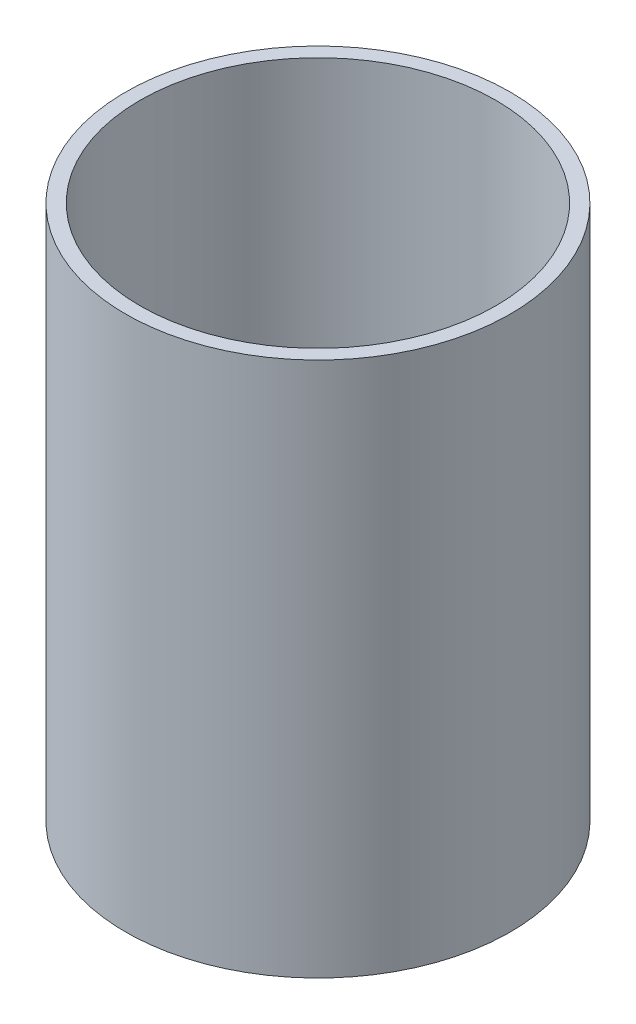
from build123d import *

# Parameters (mm, degrees)
SKETCH1_R           = 109.5375
SKETCH1_R_2         = 101.3587
BOSS_EXTRUDE1_DEPTH = 304.8


with BuildPart() as part:
    # Sketch1 → Boss-Extrude1 (new body)
    with BuildSketch(Plane(origin=(0, 0, 0), x_dir=(1, 0, 0), z_dir=(0, 1, 0))):
        with Locations(Location((0, 0, 0), (0, 0, 90))):
            Circle(SKETCH1_R)
        with Locations(Location((0, 0, 0), (0, 0, 90))):
            Circle(SKETCH1_R_2, mode=Mode.SUBTRACT)
    extrude(amount=BOSS_EXTRUDE1_DEPTH)


solid = part.part
